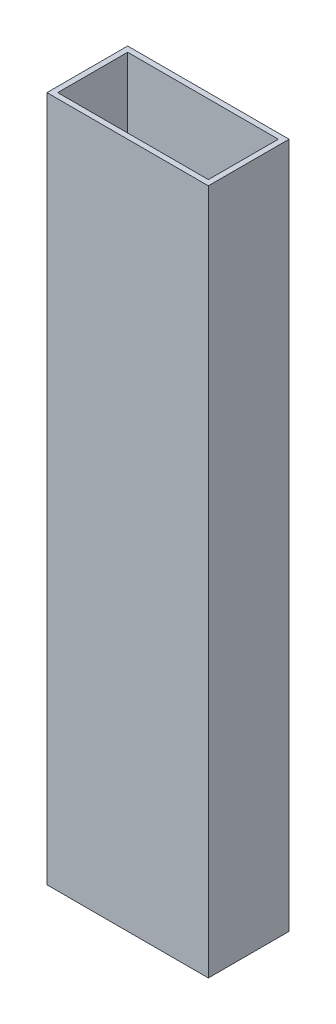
from build123d import *

# Parameters (mm, degrees)
SKETCH1_W           = 60
SKETCH1_H           = 30
SKETCH1_W_2         = 56
SKETCH1_H_2         = 26
BOSS_EXTRUDE1_DEPTH = 255


with BuildPart() as part:
    # Sketch1 → Boss-Extrude1 (new body)
    with BuildSketch(Plane(origin=(0, 0, 0), x_dir=(1, 0, 0), z_dir=(0, 1, 0))):
        Rectangle(SKETCH1_W, SKETCH1_H)
        Rectangle(SKETCH1_W_2, SKETCH1_H_2, mode=Mode.SUBTRACT)
    extrude(amount=BOSS_EXTRUDE1_DEPTH)


solid = part.part
